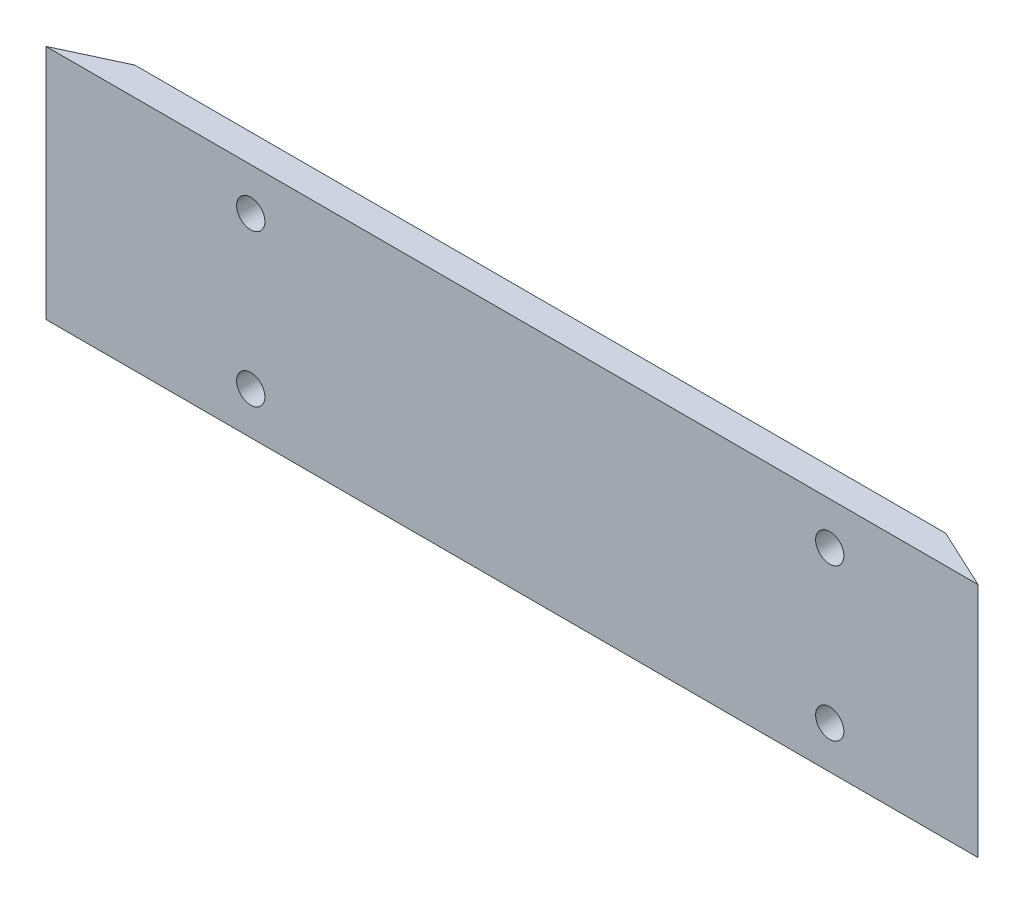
ISO-10303-21;
HEADER;
FILE_DESCRIPTION(('STEP AP214'),'2;1');
FILE_NAME('part.step','',(''),(''),'','','');
FILE_SCHEMA(('AUTOMOTIVE_DESIGN { 1 0 10303 214 1 1 1 1 }'));
ENDSEC;
DATA;
#1=APPLICATION_CONTEXT('core data for automotive mechanical design processes');
#2=APPLICATION_PROTOCOL_DEFINITION('international standard','automotive_design',2000,#1);
#3=PRODUCT_CONTEXT('',#1,'mechanical');
#4=PRODUCT('Part','Part','',(#3));
#5=PRODUCT_RELATED_PRODUCT_CATEGORY('part','',(#4));
#6=PRODUCT_DEFINITION_FORMATION('','',#4);
#7=PRODUCT_DEFINITION_CONTEXT('part definition',#1,'design');
#8=PRODUCT_DEFINITION('design','',#6,#7);
#9=PRODUCT_DEFINITION_SHAPE('','',#8);
#10=(LENGTH_UNIT() NAMED_UNIT(*) SI_UNIT(.MILLI.,.METRE.));
#11=(NAMED_UNIT(*) PLANE_ANGLE_UNIT() SI_UNIT($,.RADIAN.));
#12=(NAMED_UNIT(*) SI_UNIT($,.STERADIAN.) SOLID_ANGLE_UNIT());
#13=UNCERTAINTY_MEASURE_WITH_UNIT(LENGTH_MEASURE(1.E-05),#10,'distance_accuracy_value','');
#14=(GEOMETRIC_REPRESENTATION_CONTEXT(3) GLOBAL_UNCERTAINTY_ASSIGNED_CONTEXT((#13)) GLOBAL_UNIT_ASSIGNED_CONTEXT((#10,
#11,#12)) REPRESENTATION_CONTEXT('',''));
#15=CARTESIAN_POINT('',(0.,0.,0.));
#16=DIRECTION('',(0.,0.,1.));
#17=DIRECTION('',(1.,0.,0.));
#18=AXIS2_PLACEMENT_3D('',#15,#16,#17);
#19=CARTESIAN_POINT('',(-444.5,106.3625,12.7));
#20=DIRECTION('',(0.,0.,-1.));
#21=DIRECTION('',(-1.,0.,0.));
#22=AXIS2_PLACEMENT_3D('',#19,#20,#21);
#23=PLANE('',#22);
#24=CARTESIAN_POINT('',(260.35,-68.2625,12.7));
#25=DIRECTION('',(0.,0.,1.));
#26=DIRECTION('',(1.,0.,0.));
#27=AXIS2_PLACEMENT_3D('',#24,#25,#26);
#28=CIRCLE('',#27,12.7);
#29=CARTESIAN_POINT('',(273.05,-68.2625,12.7));
#30=VERTEX_POINT('',#29);
#31=EDGE_CURVE('E140',#30,#30,#28,.T.);
#32=ORIENTED_EDGE('',*,*,#31,.F.);
#33=EDGE_LOOP('',(#32));
#34=FACE_BOUND('',#33,.T.);
#35=CARTESIAN_POINT('',(-260.35,68.2625,12.7));
#36=DIRECTION('',(0.,0.,-1.));
#37=DIRECTION('',(-1.,0.,0.));
#38=AXIS2_PLACEMENT_3D('',#35,#36,#37);
#39=CIRCLE('',#38,12.7);
#40=CARTESIAN_POINT('',(-273.05,68.2625,12.7));
#41=VERTEX_POINT('',#40);
#42=EDGE_CURVE('E144',#41,#41,#39,.T.);
#43=ORIENTED_EDGE('',*,*,#42,.T.);
#44=EDGE_LOOP('',(#43));
#45=FACE_BOUND('',#44,.T.);
#46=CARTESIAN_POINT('',(-260.35,-68.2625,12.7));
#47=DIRECTION('',(0.,0.,-1.));
#48=DIRECTION('',(-1.,0.,0.));
#49=AXIS2_PLACEMENT_3D('',#46,#47,#48);
#50=CIRCLE('',#49,12.7);
#51=CARTESIAN_POINT('',(-273.05,-68.2625,12.7));
#52=VERTEX_POINT('',#51);
#53=EDGE_CURVE('E147',#52,#52,#50,.T.);
#54=ORIENTED_EDGE('',*,*,#53,.T.);
#55=EDGE_LOOP('',(#54));
#56=FACE_BOUND('',#55,.T.);
#57=DIRECTION('',(1.,0.,0.));
#58=VECTOR('',#57,1.);
#59=CARTESIAN_POINT('',(-444.5,-106.3625,12.7));
#60=LINE('',#59,#58);
#61=CARTESIAN_POINT('',(-444.5,-106.3625,12.7));
#62=VERTEX_POINT('',#61);
#63=CARTESIAN_POINT('',(393.7,-106.3625,12.7));
#64=VERTEX_POINT('',#63);
#65=EDGE_CURVE('E80',#62,#64,#60,.T.);
#66=ORIENTED_EDGE('',*,*,#65,.T.);
#67=DIRECTION('',(0.,-1.,0.));
#68=VECTOR('',#67,1.);
#69=CARTESIAN_POINT('',(393.7,106.3625,12.7));
#70=LINE('',#69,#68);
#71=CARTESIAN_POINT('',(393.7,106.3625,12.7));
#72=VERTEX_POINT('',#71);
#73=EDGE_CURVE('E47',#72,#64,#70,.T.);
#74=ORIENTED_EDGE('',*,*,#73,.F.);
#75=DIRECTION('',(1.,0.,0.));
#76=VECTOR('',#75,1.);
#77=CARTESIAN_POINT('',(-444.5,106.3625,12.7));
#78=LINE('',#77,#76);
#79=CARTESIAN_POINT('',(-444.5,106.3625,12.7));
#80=VERTEX_POINT('',#79);
#81=EDGE_CURVE('E92',#80,#72,#78,.T.);
#82=ORIENTED_EDGE('',*,*,#81,.F.);
#83=DIRECTION('',(0.,-1.,0.));
#84=VECTOR('',#83,1.);
#85=CARTESIAN_POINT('',(-444.5,106.3625,12.7));
#86=LINE('',#85,#84);
#87=EDGE_CURVE('E11',#80,#62,#86,.T.);
#88=ORIENTED_EDGE('',*,*,#87,.T.);
#89=EDGE_LOOP('',(#66,#74,#82,#88));
#90=FACE_BOUND('',#89,.T.);
#91=CARTESIAN_POINT('',(260.35,68.2625,12.7));
#92=DIRECTION('',(0.,0.,1.));
#93=DIRECTION('',(1.,0.,0.));
#94=AXIS2_PLACEMENT_3D('',#91,#92,#93);
#95=CIRCLE('',#94,12.7);
#96=CARTESIAN_POINT('',(273.05,68.2625,12.7));
#97=VERTEX_POINT('',#96);
#98=EDGE_CURVE('E224',#97,#97,#95,.T.);
#99=ORIENTED_EDGE('',*,*,#98,.F.);
#100=EDGE_LOOP('',(#99));
#101=FACE_BOUND('',#100,.T.);
#102=ADVANCED_FACE('F39',(#34,#45,#56,#90,#101),#23,.F.);
#103=CARTESIAN_POINT('',(-390.029524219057,106.3625,-12.7));
#104=DIRECTION('',(0.,0.,1.));
#105=DIRECTION('',(1.,0.,0.));
#106=AXIS2_PLACEMENT_3D('',#103,#104,#105);
#107=PLANE('',#106);
#108=CARTESIAN_POINT('',(260.35,68.2625,-12.7));
#109=DIRECTION('',(0.,0.,1.));
#110=DIRECTION('',(1.,0.,0.));
#111=AXIS2_PLACEMENT_3D('',#108,#109,#110);
#112=CIRCLE('',#111,4.953);
#113=CARTESIAN_POINT('',(265.303,68.2625,-12.7));
#114=VERTEX_POINT('',#113);
#115=EDGE_CURVE('E240',#114,#114,#112,.T.);
#116=ORIENTED_EDGE('',*,*,#115,.T.);
#117=EDGE_LOOP('',(#116));
#118=FACE_BOUND('',#117,.T.);
#119=CARTESIAN_POINT('',(-260.35,-68.2625,-12.7));
#120=DIRECTION('',(0.,0.,-1.));
#121=DIRECTION('',(-1.,0.,0.));
#122=AXIS2_PLACEMENT_3D('',#119,#120,#121);
#123=CIRCLE('',#122,4.953);
#124=CARTESIAN_POINT('',(-265.303,-68.2625,-12.7));
#125=VERTEX_POINT('',#124);
#126=EDGE_CURVE('E100',#125,#125,#123,.T.);
#127=ORIENTED_EDGE('',*,*,#126,.F.);
#128=EDGE_LOOP('',(#127));
#129=FACE_BOUND('',#128,.T.);
#130=CARTESIAN_POINT('',(-260.35,68.2625,-12.7));
#131=DIRECTION('',(0.,0.,-1.));
#132=DIRECTION('',(-1.,0.,0.));
#133=AXIS2_PLACEMENT_3D('',#130,#131,#132);
#134=CIRCLE('',#133,4.953);
#135=CARTESIAN_POINT('',(-265.303,68.2625,-12.7));
#136=VERTEX_POINT('',#135);
#137=EDGE_CURVE('E97',#136,#136,#134,.T.);
#138=ORIENTED_EDGE('',*,*,#137,.F.);
#139=EDGE_LOOP('',(#138));
#140=FACE_BOUND('',#139,.T.);
#141=DIRECTION('',(-1.,0.,0.));
#142=VECTOR('',#141,1.);
#143=CARTESIAN_POINT('',(-390.029524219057,-106.3625,-12.7));
#144=LINE('',#143,#142);
#145=CARTESIAN_POINT('',(339.229524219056,-106.3625,-12.7));
#146=VERTEX_POINT('',#145);
#147=CARTESIAN_POINT('',(-390.029524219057,-106.3625,-12.7));
#148=VERTEX_POINT('',#147);
#149=EDGE_CURVE('E105',#146,#148,#144,.T.);
#150=ORIENTED_EDGE('',*,*,#149,.T.);
#151=DIRECTION('',(0.,-1.,0.));
#152=VECTOR('',#151,1.);
#153=CARTESIAN_POINT('',(-390.029524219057,106.3625,-12.7));
#154=LINE('',#153,#152);
#155=CARTESIAN_POINT('',(-390.029524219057,106.3625,-12.7));
#156=VERTEX_POINT('',#155);
#157=EDGE_CURVE('E96',#156,#148,#154,.T.);
#158=ORIENTED_EDGE('',*,*,#157,.F.);
#159=DIRECTION('',(-1.,0.,0.));
#160=VECTOR('',#159,1.);
#161=CARTESIAN_POINT('',(-390.029524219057,106.3625,-12.7));
#162=LINE('',#161,#160);
#163=CARTESIAN_POINT('',(339.229524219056,106.3625,-12.7));
#164=VERTEX_POINT('',#163);
#165=EDGE_CURVE('E54',#164,#156,#162,.T.);
#166=ORIENTED_EDGE('',*,*,#165,.F.);
#167=DIRECTION('',(0.,-1.,0.));
#168=VECTOR('',#167,1.);
#169=CARTESIAN_POINT('',(339.229524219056,106.3625,-12.7));
#170=LINE('',#169,#168);
#171=EDGE_CURVE('E113',#164,#146,#170,.T.);
#172=ORIENTED_EDGE('',*,*,#171,.T.);
#173=EDGE_LOOP('',(#150,#158,#166,#172));
#174=FACE_BOUND('',#173,.T.);
#175=CARTESIAN_POINT('',(260.35,-68.2625,-12.7));
#176=DIRECTION('',(0.,0.,1.));
#177=DIRECTION('',(1.,0.,0.));
#178=AXIS2_PLACEMENT_3D('',#175,#176,#177);
#179=CIRCLE('',#178,4.953);
#180=CARTESIAN_POINT('',(265.303,-68.2625,-12.7));
#181=VERTEX_POINT('',#180);
#182=EDGE_CURVE('E237',#181,#181,#179,.T.);
#183=ORIENTED_EDGE('',*,*,#182,.T.);
#184=EDGE_LOOP('',(#183));
#185=FACE_BOUND('',#184,.T.);
#186=ADVANCED_FACE('F118',(#118,#129,#140,#174,#185),#107,.F.);
#187=CARTESIAN_POINT('',(-444.5,106.3625,12.7));
#188=DIRECTION('',(0.422618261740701,0.,0.906307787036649));
#189=DIRECTION('',(0.906307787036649,0.,-0.422618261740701));
#190=AXIS2_PLACEMENT_3D('',#187,#188,#189);
#191=PLANE('',#190);
#192=DIRECTION('',(-0.906307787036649,0.,0.422618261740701));
#193=VECTOR('',#192,1.);
#194=CARTESIAN_POINT('',(-444.5,-106.3625,12.7));
#195=LINE('',#194,#193);
#196=EDGE_CURVE('E84',#148,#62,#195,.T.);
#197=ORIENTED_EDGE('',*,*,#196,.T.);
#198=ORIENTED_EDGE('',*,*,#87,.F.);
#199=DIRECTION('',(-0.906307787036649,0.,0.422618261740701));
#200=VECTOR('',#199,1.);
#201=CARTESIAN_POINT('',(-444.5,106.3625,12.7));
#202=LINE('',#201,#200);
#203=EDGE_CURVE('E107',#156,#80,#202,.T.);
#204=ORIENTED_EDGE('',*,*,#203,.F.);
#205=ORIENTED_EDGE('',*,*,#157,.T.);
#206=EDGE_LOOP('',(#197,#198,#204,#205));
#207=FACE_BOUND('',#206,.T.);
#208=ADVANCED_FACE('F41',(#207),#191,.F.);
#209=CARTESIAN_POINT('',(393.7,106.3625,12.7));
#210=DIRECTION('',(-0.422618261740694,0.,0.906307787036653));
#211=DIRECTION('',(0.906307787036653,0.,0.422618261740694));
#212=AXIS2_PLACEMENT_3D('',#209,#210,#211);
#213=PLANE('',#212);
#214=DIRECTION('',(-0.906307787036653,0.,-0.422618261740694));
#215=VECTOR('',#214,1.);
#216=CARTESIAN_POINT('',(393.7,-106.3625,12.7));
#217=LINE('',#216,#215);
#218=EDGE_CURVE('E85',#64,#146,#217,.T.);
#219=ORIENTED_EDGE('',*,*,#218,.T.);
#220=ORIENTED_EDGE('',*,*,#171,.F.);
#221=DIRECTION('',(-0.906307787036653,0.,-0.422618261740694));
#222=VECTOR('',#221,1.);
#223=CARTESIAN_POINT('',(393.7,106.3625,12.7));
#224=LINE('',#223,#222);
#225=EDGE_CURVE('E59',#72,#164,#224,.T.);
#226=ORIENTED_EDGE('',*,*,#225,.F.);
#227=ORIENTED_EDGE('',*,*,#73,.T.);
#228=EDGE_LOOP('',(#219,#220,#226,#227));
#229=FACE_BOUND('',#228,.T.);
#230=ADVANCED_FACE('F116',(#229),#213,.F.);
#231=CARTESIAN_POINT('',(-25.4000000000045,106.3625,-182.729539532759));
#232=DIRECTION('',(0.,1.,0.));
#233=DIRECTION('',(0.,0.,1.));
#234=AXIS2_PLACEMENT_3D('',#231,#232,#233);
#235=PLANE('',#234);
#236=ORIENTED_EDGE('',*,*,#203,.T.);
#237=ORIENTED_EDGE('',*,*,#81,.T.);
#238=ORIENTED_EDGE('',*,*,#225,.T.);
#239=ORIENTED_EDGE('',*,*,#165,.T.);
#240=EDGE_LOOP('',(#236,#237,#238,#239));
#241=FACE_BOUND('',#240,.T.);
#242=ADVANCED_FACE('F120',(#241),#235,.T.);
#243=CARTESIAN_POINT('',(-25.4000000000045,-106.3625,-182.729539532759));
#244=DIRECTION('',(0.,1.,0.));
#245=DIRECTION('',(0.,0.,1.));
#246=AXIS2_PLACEMENT_3D('',#243,#244,#245);
#247=PLANE('',#246);
#248=ORIENTED_EDGE('',*,*,#196,.F.);
#249=ORIENTED_EDGE('',*,*,#149,.F.);
#250=ORIENTED_EDGE('',*,*,#218,.F.);
#251=ORIENTED_EDGE('',*,*,#65,.F.);
#252=EDGE_LOOP('',(#248,#249,#250,#251));
#253=FACE_BOUND('',#252,.T.);
#254=ADVANCED_FACE('F81',(#253),#247,.F.);
#255=CARTESIAN_POINT('',(-260.35,68.2625,-6.35));
#256=DIRECTION('',(0.,0.,-1.));
#257=DIRECTION('',(-1.,0.,0.));
#258=AXIS2_PLACEMENT_3D('',#255,#256,#257);
#259=CYLINDRICAL_SURFACE('',#258,4.953);
#260=CARTESIAN_POINT('',(-260.35,68.2625,-6.35));
#261=DIRECTION('',(0.,0.,-1.));
#262=DIRECTION('',(-1.,0.,0.));
#263=AXIS2_PLACEMENT_3D('',#260,#261,#262);
#264=CIRCLE('',#263,4.953);
#265=CARTESIAN_POINT('',(-265.303,68.2625,-6.35));
#266=VERTEX_POINT('',#265);
#267=EDGE_CURVE('E155',#266,#266,#264,.F.);
#268=ORIENTED_EDGE('',*,*,#267,.T.);
#269=EDGE_LOOP('',(#268));
#270=FACE_BOUND('',#269,.T.);
#271=ORIENTED_EDGE('',*,*,#137,.T.);
#272=EDGE_LOOP('',(#271));
#273=FACE_BOUND('',#272,.T.);
#274=ADVANCED_FACE('F127',(#270,#273),#259,.F.);
#275=CARTESIAN_POINT('',(-260.35,-68.2625,-6.35));
#276=DIRECTION('',(0.,0.,-1.));
#277=DIRECTION('',(-1.,0.,0.));
#278=AXIS2_PLACEMENT_3D('',#275,#276,#277);
#279=CYLINDRICAL_SURFACE('',#278,4.953);
#280=CARTESIAN_POINT('',(-260.35,-68.2625,-6.35));
#281=DIRECTION('',(0.,0.,-1.));
#282=DIRECTION('',(-1.,0.,0.));
#283=AXIS2_PLACEMENT_3D('',#280,#281,#282);
#284=CIRCLE('',#283,4.953);
#285=CARTESIAN_POINT('',(-265.303,-68.2625,-6.35));
#286=VERTEX_POINT('',#285);
#287=EDGE_CURVE('E149',#286,#286,#284,.F.);
#288=ORIENTED_EDGE('',*,*,#287,.T.);
#289=EDGE_LOOP('',(#288));
#290=FACE_BOUND('',#289,.T.);
#291=ORIENTED_EDGE('',*,*,#126,.T.);
#292=EDGE_LOOP('',(#291));
#293=FACE_BOUND('',#292,.T.);
#294=ADVANCED_FACE('F161',(#290,#293),#279,.F.);
#295=CARTESIAN_POINT('',(-260.35,-68.2625,-6.35));
#296=DIRECTION('',(0.,0.,-1.));
#297=DIRECTION('',(-1.,0.,0.));
#298=AXIS2_PLACEMENT_3D('',#295,#296,#297);
#299=PLANE('',#298);
#300=CARTESIAN_POINT('',(-260.35,-68.2625,-6.35));
#301=DIRECTION('',(0.,0.,-1.));
#302=DIRECTION('',(-1.,0.,0.));
#303=AXIS2_PLACEMENT_3D('',#300,#301,#302);
#304=CIRCLE('',#303,12.7);
#305=CARTESIAN_POINT('',(-273.05,-68.2625,-6.35));
#306=VERTEX_POINT('',#305);
#307=EDGE_CURVE('E150',#306,#306,#304,.T.);
#308=ORIENTED_EDGE('',*,*,#307,.F.);
#309=EDGE_LOOP('',(#308));
#310=FACE_BOUND('',#309,.T.);
#311=ORIENTED_EDGE('',*,*,#287,.F.);
#312=EDGE_LOOP('',(#311));
#313=FACE_BOUND('',#312,.T.);
#314=ADVANCED_FACE('F172',(#310,#313),#299,.F.);
#315=CARTESIAN_POINT('',(-260.35,-68.2625,12.7));
#316=DIRECTION('',(0.,0.,-1.));
#317=DIRECTION('',(-1.,0.,0.));
#318=AXIS2_PLACEMENT_3D('',#315,#316,#317);
#319=CYLINDRICAL_SURFACE('',#318,12.7);
#320=CARTESIAN_POINT('',(-273.05,-68.2625,12.7));
#321=CARTESIAN_POINT('',(-273.05,-68.2625,12.5015625));
#322=CARTESIAN_POINT('',(-273.05,-68.2625,12.303125));
#323=CARTESIAN_POINT('',(-273.05,-68.2625,11.90625));
#324=CARTESIAN_POINT('',(-273.05,-68.2625,11.7078125));
#325=CARTESIAN_POINT('',(-273.05,-68.2625,11.3109375));
#326=CARTESIAN_POINT('',(-273.05,-68.2625,11.1125));
#327=CARTESIAN_POINT('',(-273.05,-68.2625,10.715625));
#328=CARTESIAN_POINT('',(-273.05,-68.2625,10.5171875));
#329=CARTESIAN_POINT('',(-273.05,-68.2625,10.1203125));
#330=CARTESIAN_POINT('',(-273.05,-68.2625,9.92187500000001));
#331=CARTESIAN_POINT('',(-273.05,-68.2625,9.525));
#332=CARTESIAN_POINT('',(-273.05,-68.2625,9.3265625));
#333=CARTESIAN_POINT('',(-273.05,-68.2625,8.92968750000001));
#334=CARTESIAN_POINT('',(-273.05,-68.2625,8.73125));
#335=CARTESIAN_POINT('',(-273.05,-68.2625,8.334375));
#336=CARTESIAN_POINT('',(-273.05,-68.2625,8.13593750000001));
#337=CARTESIAN_POINT('',(-273.05,-68.2625,7.73906250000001));
#338=CARTESIAN_POINT('',(-273.05,-68.2625,7.540625));
#339=CARTESIAN_POINT('',(-273.05,-68.2625,7.14375000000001));
#340=CARTESIAN_POINT('',(-273.05,-68.2625,6.9453125));
#341=CARTESIAN_POINT('',(-273.05,-68.2625,6.5484375));
#342=CARTESIAN_POINT('',(-273.05,-68.2625,6.35));
#343=CARTESIAN_POINT('',(-273.05,-68.2625,5.95312500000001));
#344=CARTESIAN_POINT('',(-273.05,-68.2625,5.7546875));
#345=CARTESIAN_POINT('',(-273.05,-68.2625,5.3578125));
#346=CARTESIAN_POINT('',(-273.05,-68.2625,5.159375));
#347=CARTESIAN_POINT('',(-273.05,-68.2625,4.76250000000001));
#348=CARTESIAN_POINT('',(-273.05,-68.2625,4.56406250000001));
#349=CARTESIAN_POINT('',(-273.05,-68.2625,4.16718750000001));
#350=CARTESIAN_POINT('',(-273.05,-68.2625,3.96875000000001));
#351=CARTESIAN_POINT('',(-273.05,-68.2625,3.57187500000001));
#352=CARTESIAN_POINT('',(-273.05,-68.2625,3.37343750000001));
#353=CARTESIAN_POINT('',(-273.05,-68.2625,2.97656250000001));
#354=CARTESIAN_POINT('',(-273.05,-68.2625,2.77812500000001));
#355=CARTESIAN_POINT('',(-273.05,-68.2625,2.38125000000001));
#356=CARTESIAN_POINT('',(-273.05,-68.2625,2.18281250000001));
#357=CARTESIAN_POINT('',(-273.05,-68.2625,1.78593750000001));
#358=CARTESIAN_POINT('',(-273.05,-68.2625,1.58750000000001));
#359=CARTESIAN_POINT('',(-273.05,-68.2625,1.190625));
#360=CARTESIAN_POINT('',(-273.05,-68.2625,0.992187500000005));
#361=CARTESIAN_POINT('',(-273.05,-68.2625,0.595312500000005));
#362=CARTESIAN_POINT('',(-273.05,-68.2625,0.396875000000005));
#363=CARTESIAN_POINT('',(-273.05,-68.2625,0.));
#364=CARTESIAN_POINT('',(-273.05,-68.2625,-0.198437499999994));
#365=CARTESIAN_POINT('',(-273.05,-68.2625,-0.595312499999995));
#366=CARTESIAN_POINT('',(-273.05,-68.2625,-0.793749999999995));
#367=CARTESIAN_POINT('',(-273.05,-68.2625,-1.19062499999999));
#368=CARTESIAN_POINT('',(-273.05,-68.2625,-1.3890625));
#369=CARTESIAN_POINT('',(-273.05,-68.2625,-1.7859375));
#370=CARTESIAN_POINT('',(-273.05,-68.2625,-1.984375));
#371=CARTESIAN_POINT('',(-273.05,-68.2625,-2.38125));
#372=CARTESIAN_POINT('',(-273.05,-68.2625,-2.5796875));
#373=CARTESIAN_POINT('',(-273.05,-68.2625,-2.9765625));
#374=CARTESIAN_POINT('',(-273.05,-68.2625,-3.17499999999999));
#375=CARTESIAN_POINT('',(-273.05,-68.2625,-3.57187499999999));
#376=CARTESIAN_POINT('',(-273.05,-68.2625,-3.77031249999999));
#377=CARTESIAN_POINT('',(-273.05,-68.2625,-4.16718749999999));
#378=CARTESIAN_POINT('',(-273.05,-68.2625,-4.365625));
#379=CARTESIAN_POINT('',(-273.05,-68.2625,-4.76249999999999));
#380=CARTESIAN_POINT('',(-273.05,-68.2625,-4.9609375));
#381=CARTESIAN_POINT('',(-273.05,-68.2625,-5.3578125));
#382=CARTESIAN_POINT('',(-273.05,-68.2625,-5.55625));
#383=CARTESIAN_POINT('',(-273.05,-68.2625,-5.953125));
#384=CARTESIAN_POINT('',(-273.05,-68.2625,-6.1515625));
#385=CARTESIAN_POINT('',(-273.05,-68.2625,-6.35));
#386=B_SPLINE_CURVE_WITH_KNOTS('',3,(#320,#321,#322,#323,#324,#325,#326,#327,#328,#329,#330,
#331,#332,#333,#334,#335,#336,#337,#338,#339,#340,#341,#342,#343,#344,#345,#346,#347,#348,#349,
#350,#351,#352,#353,#354,#355,#356,#357,#358,#359,#360,#361,#362,#363,#364,#365,#366,#367,#368,
#369,#370,#371,#372,#373,#374,#375,#376,#377,#378,#379,#380,#381,#382,#383,#384,#385),
.UNSPECIFIED.,.F.,.F.,(4,2,2,2,2,2,2,2,2,2,2,2,2,2,2,2,2,2,2,2,2,2,2,2,2,2,2,2,2,2,2,2,4),(0.,
0.5953125,1.190625,1.7859375,2.38125,2.9765625,3.571875,4.1671875,4.7625,5.3578125,5.953125,
6.5484375,7.14375,7.7390625,8.334375,8.9296875,9.525,10.1203125,10.715625,11.3109375,11.90625,
12.5015625,13.096875,13.6921875,14.2875,14.8828125,15.478125,16.0734375,16.66875,17.2640625,
17.859375,18.4546875,19.05),.UNSPECIFIED.);
#387=EDGE_CURVE('BSEAM177',#52,#306,#386,.T.);
#388=ORIENTED_EDGE('',*,*,#53,.F.);
#389=ORIENTED_EDGE('',*,*,#307,.T.);
#390=ORIENTED_EDGE('',*,*,#387,.T.);
#391=ORIENTED_EDGE('',*,*,#387,.F.);
#392=EDGE_LOOP('',(#388,#390,#389,#391));
#393=FACE_BOUND('',#392,.T.);
#394=ADVANCED_FACE('F177',(#393),#319,.F.);
#395=CARTESIAN_POINT('',(-260.35,68.2625,-6.35));
#396=DIRECTION('',(0.,0.,-1.));
#397=DIRECTION('',(-1.,0.,0.));
#398=AXIS2_PLACEMENT_3D('',#395,#396,#397);
#399=PLANE('',#398);
#400=CARTESIAN_POINT('',(-260.35,68.2625,-6.35));
#401=DIRECTION('',(0.,0.,-1.));
#402=DIRECTION('',(-1.,0.,0.));
#403=AXIS2_PLACEMENT_3D('',#400,#401,#402);
#404=CIRCLE('',#403,12.7);
#405=CARTESIAN_POINT('',(-273.05,68.2625,-6.35));
#406=VERTEX_POINT('',#405);
#407=EDGE_CURVE('E243',#406,#406,#404,.T.);
#408=ORIENTED_EDGE('',*,*,#407,.F.);
#409=EDGE_LOOP('',(#408));
#410=FACE_BOUND('',#409,.T.);
#411=ORIENTED_EDGE('',*,*,#267,.F.);
#412=EDGE_LOOP('',(#411));
#413=FACE_BOUND('',#412,.T.);
#414=ADVANCED_FACE('F180',(#410,#413),#399,.F.);
#415=CARTESIAN_POINT('',(-260.35,68.2625,12.7));
#416=DIRECTION('',(0.,0.,-1.));
#417=DIRECTION('',(-1.,0.,0.));
#418=AXIS2_PLACEMENT_3D('',#415,#416,#417);
#419=CYLINDRICAL_SURFACE('',#418,12.7);
#420=CARTESIAN_POINT('',(-273.05,68.2625,12.7));
#421=CARTESIAN_POINT('',(-273.05,68.2625,12.5015625));
#422=CARTESIAN_POINT('',(-273.05,68.2625,12.303125));
#423=CARTESIAN_POINT('',(-273.05,68.2625,11.90625));
#424=CARTESIAN_POINT('',(-273.05,68.2625,11.7078125));
#425=CARTESIAN_POINT('',(-273.05,68.2625,11.3109375));
#426=CARTESIAN_POINT('',(-273.05,68.2625,11.1125));
#427=CARTESIAN_POINT('',(-273.05,68.2625,10.715625));
#428=CARTESIAN_POINT('',(-273.05,68.2625,10.5171875));
#429=CARTESIAN_POINT('',(-273.05,68.2625,10.1203125));
#430=CARTESIAN_POINT('',(-273.05,68.2625,9.92187500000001));
#431=CARTESIAN_POINT('',(-273.05,68.2625,9.525));
#432=CARTESIAN_POINT('',(-273.05,68.2625,9.3265625));
#433=CARTESIAN_POINT('',(-273.05,68.2625,8.92968750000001));
#434=CARTESIAN_POINT('',(-273.05,68.2625,8.73125));
#435=CARTESIAN_POINT('',(-273.05,68.2625,8.334375));
#436=CARTESIAN_POINT('',(-273.05,68.2625,8.13593750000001));
#437=CARTESIAN_POINT('',(-273.05,68.2625,7.73906250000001));
#438=CARTESIAN_POINT('',(-273.05,68.2625,7.540625));
#439=CARTESIAN_POINT('',(-273.05,68.2625,7.14375000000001));
#440=CARTESIAN_POINT('',(-273.05,68.2625,6.9453125));
#441=CARTESIAN_POINT('',(-273.05,68.2625,6.5484375));
#442=CARTESIAN_POINT('',(-273.05,68.2625,6.35));
#443=CARTESIAN_POINT('',(-273.05,68.2625,5.95312500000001));
#444=CARTESIAN_POINT('',(-273.05,68.2625,5.7546875));
#445=CARTESIAN_POINT('',(-273.05,68.2625,5.3578125));
#446=CARTESIAN_POINT('',(-273.05,68.2625,5.159375));
#447=CARTESIAN_POINT('',(-273.05,68.2625,4.76250000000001));
#448=CARTESIAN_POINT('',(-273.05,68.2625,4.56406250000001));
#449=CARTESIAN_POINT('',(-273.05,68.2625,4.16718750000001));
#450=CARTESIAN_POINT('',(-273.05,68.2625,3.96875000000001));
#451=CARTESIAN_POINT('',(-273.05,68.2625,3.57187500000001));
#452=CARTESIAN_POINT('',(-273.05,68.2625,3.37343750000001));
#453=CARTESIAN_POINT('',(-273.05,68.2625,2.97656250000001));
#454=CARTESIAN_POINT('',(-273.05,68.2625,2.77812500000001));
#455=CARTESIAN_POINT('',(-273.05,68.2625,2.38125000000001));
#456=CARTESIAN_POINT('',(-273.05,68.2625,2.18281250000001));
#457=CARTESIAN_POINT('',(-273.05,68.2625,1.78593750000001));
#458=CARTESIAN_POINT('',(-273.05,68.2625,1.58750000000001));
#459=CARTESIAN_POINT('',(-273.05,68.2625,1.190625));
#460=CARTESIAN_POINT('',(-273.05,68.2625,0.992187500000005));
#461=CARTESIAN_POINT('',(-273.05,68.2625,0.595312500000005));
#462=CARTESIAN_POINT('',(-273.05,68.2625,0.396875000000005));
#463=CARTESIAN_POINT('',(-273.05,68.2625,0.));
#464=CARTESIAN_POINT('',(-273.05,68.2625,-0.198437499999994));
#465=CARTESIAN_POINT('',(-273.05,68.2625,-0.595312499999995));
#466=CARTESIAN_POINT('',(-273.05,68.2625,-0.793749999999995));
#467=CARTESIAN_POINT('',(-273.05,68.2625,-1.19062499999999));
#468=CARTESIAN_POINT('',(-273.05,68.2625,-1.3890625));
#469=CARTESIAN_POINT('',(-273.05,68.2625,-1.7859375));
#470=CARTESIAN_POINT('',(-273.05,68.2625,-1.984375));
#471=CARTESIAN_POINT('',(-273.05,68.2625,-2.38125));
#472=CARTESIAN_POINT('',(-273.05,68.2625,-2.5796875));
#473=CARTESIAN_POINT('',(-273.05,68.2625,-2.9765625));
#474=CARTESIAN_POINT('',(-273.05,68.2625,-3.17499999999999));
#475=CARTESIAN_POINT('',(-273.05,68.2625,-3.57187499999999));
#476=CARTESIAN_POINT('',(-273.05,68.2625,-3.77031249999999));
#477=CARTESIAN_POINT('',(-273.05,68.2625,-4.16718749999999));
#478=CARTESIAN_POINT('',(-273.05,68.2625,-4.365625));
#479=CARTESIAN_POINT('',(-273.05,68.2625,-4.76249999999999));
#480=CARTESIAN_POINT('',(-273.05,68.2625,-4.9609375));
#481=CARTESIAN_POINT('',(-273.05,68.2625,-5.3578125));
#482=CARTESIAN_POINT('',(-273.05,68.2625,-5.55625));
#483=CARTESIAN_POINT('',(-273.05,68.2625,-5.953125));
#484=CARTESIAN_POINT('',(-273.05,68.2625,-6.1515625));
#485=CARTESIAN_POINT('',(-273.05,68.2625,-6.35));
#486=B_SPLINE_CURVE_WITH_KNOTS('',3,(#420,#421,#422,#423,#424,#425,#426,#427,#428,#429,#430,
#431,#432,#433,#434,#435,#436,#437,#438,#439,#440,#441,#442,#443,#444,#445,#446,#447,#448,#449,
#450,#451,#452,#453,#454,#455,#456,#457,#458,#459,#460,#461,#462,#463,#464,#465,#466,#467,#468,
#469,#470,#471,#472,#473,#474,#475,#476,#477,#478,#479,#480,#481,#482,#483,#484,#485),
.UNSPECIFIED.,.F.,.F.,(4,2,2,2,2,2,2,2,2,2,2,2,2,2,2,2,2,2,2,2,2,2,2,2,2,2,2,2,2,2,2,2,4),(0.,
0.5953125,1.190625,1.7859375,2.38125,2.9765625,3.571875,4.1671875,4.7625,5.3578125,5.953125,
6.5484375,7.14375,7.7390625,8.334375,8.9296875,9.525,10.1203125,10.715625,11.3109375,11.90625,
12.5015625,13.096875,13.6921875,14.2875,14.8828125,15.478125,16.0734375,16.66875,17.2640625,
17.859375,18.4546875,19.05),.UNSPECIFIED.);
#487=EDGE_CURVE('BSEAM184',#41,#406,#486,.T.);
#488=ORIENTED_EDGE('',*,*,#42,.F.);
#489=ORIENTED_EDGE('',*,*,#407,.T.);
#490=ORIENTED_EDGE('',*,*,#487,.T.);
#491=ORIENTED_EDGE('',*,*,#487,.F.);
#492=EDGE_LOOP('',(#488,#490,#489,#491));
#493=FACE_BOUND('',#492,.T.);
#494=ADVANCED_FACE('F184',(#493),#419,.F.);
#495=CARTESIAN_POINT('',(260.35,68.2625,-6.35));
#496=DIRECTION('',(0.,0.,-1.));
#497=DIRECTION('',(-1.,0.,0.));
#498=AXIS2_PLACEMENT_3D('',#495,#496,#497);
#499=CYLINDRICAL_SURFACE('',#498,4.953);
#500=CARTESIAN_POINT('',(260.35,68.2625,-6.35));
#501=DIRECTION('',(0.,0.,-1.));
#502=DIRECTION('',(-1.,0.,0.));
#503=AXIS2_PLACEMENT_3D('',#500,#501,#502);
#504=CIRCLE('',#503,4.953);
#505=CARTESIAN_POINT('',(255.397,68.2625,-6.35));
#506=VERTEX_POINT('',#505);
#507=EDGE_CURVE('E219',#506,#506,#504,.T.);
#508=ORIENTED_EDGE('',*,*,#507,.F.);
#509=EDGE_LOOP('',(#508));
#510=FACE_BOUND('',#509,.T.);
#511=ORIENTED_EDGE('',*,*,#115,.F.);
#512=EDGE_LOOP('',(#511));
#513=FACE_BOUND('',#512,.T.);
#514=ADVANCED_FACE('F187',(#510,#513),#499,.F.);
#515=CARTESIAN_POINT('',(260.35,-68.2625,-6.35));
#516=DIRECTION('',(0.,0.,-1.));
#517=DIRECTION('',(-1.,0.,0.));
#518=AXIS2_PLACEMENT_3D('',#515,#516,#517);
#519=CYLINDRICAL_SURFACE('',#518,4.953);
#520=CARTESIAN_POINT('',(260.35,-68.2625,-6.35));
#521=DIRECTION('',(0.,0.,-1.));
#522=DIRECTION('',(-1.,0.,0.));
#523=AXIS2_PLACEMENT_3D('',#520,#521,#522);
#524=CIRCLE('',#523,4.953);
#525=CARTESIAN_POINT('',(255.397,-68.2625,-6.35));
#526=VERTEX_POINT('',#525);
#527=EDGE_CURVE('E234',#526,#526,#524,.T.);
#528=ORIENTED_EDGE('',*,*,#527,.F.);
#529=EDGE_LOOP('',(#528));
#530=FACE_BOUND('',#529,.T.);
#531=ORIENTED_EDGE('',*,*,#182,.F.);
#532=EDGE_LOOP('',(#531));
#533=FACE_BOUND('',#532,.T.);
#534=ADVANCED_FACE('F194',(#530,#533),#519,.F.);
#535=CARTESIAN_POINT('',(260.35,-68.2625,12.7));
#536=DIRECTION('',(0.,0.,-1.));
#537=DIRECTION('',(-1.,0.,0.));
#538=AXIS2_PLACEMENT_3D('',#535,#536,#537);
#539=CYLINDRICAL_SURFACE('',#538,12.7);
#540=ORIENTED_EDGE('',*,*,#31,.T.);
#541=EDGE_LOOP('',(#540));
#542=FACE_BOUND('',#541,.T.);
#543=CARTESIAN_POINT('',(260.35,-68.2625,-6.35));
#544=DIRECTION('',(0.,0.,1.));
#545=DIRECTION('',(1.,0.,0.));
#546=AXIS2_PLACEMENT_3D('',#543,#544,#545);
#547=CIRCLE('',#546,12.7);
#548=CARTESIAN_POINT('',(273.05,-68.2625,-6.35));
#549=VERTEX_POINT('',#548);
#550=EDGE_CURVE('E230',#549,#549,#547,.T.);
#551=ORIENTED_EDGE('',*,*,#550,.F.);
#552=EDGE_LOOP('',(#551));
#553=FACE_BOUND('',#552,.T.);
#554=ADVANCED_FACE('F198',(#542,#553),#539,.F.);
#555=CARTESIAN_POINT('',(260.35,-68.2625,-6.35));
#556=DIRECTION('',(0.,0.,-1.));
#557=DIRECTION('',(1.,0.,0.));
#558=AXIS2_PLACEMENT_3D('',#555,#556,#557);
#559=PLANE('',#558);
#560=ORIENTED_EDGE('',*,*,#527,.T.);
#561=EDGE_LOOP('',(#560));
#562=FACE_BOUND('',#561,.T.);
#563=ORIENTED_EDGE('',*,*,#550,.T.);
#564=EDGE_LOOP('',(#563));
#565=FACE_BOUND('',#564,.T.);
#566=ADVANCED_FACE('F202',(#562,#565),#559,.F.);
#567=CARTESIAN_POINT('',(260.35,68.2625,12.7));
#568=DIRECTION('',(0.,0.,-1.));
#569=DIRECTION('',(-1.,0.,0.));
#570=AXIS2_PLACEMENT_3D('',#567,#568,#569);
#571=CYLINDRICAL_SURFACE('',#570,12.7);
#572=ORIENTED_EDGE('',*,*,#98,.T.);
#573=EDGE_LOOP('',(#572));
#574=FACE_BOUND('',#573,.T.);
#575=CARTESIAN_POINT('',(260.35,68.2625,-6.35));
#576=DIRECTION('',(0.,0.,1.));
#577=DIRECTION('',(1.,0.,0.));
#578=AXIS2_PLACEMENT_3D('',#575,#576,#577);
#579=CIRCLE('',#578,12.7);
#580=CARTESIAN_POINT('',(273.05,68.2625,-6.35));
#581=VERTEX_POINT('',#580);
#582=EDGE_CURVE('E222',#581,#581,#579,.T.);
#583=ORIENTED_EDGE('',*,*,#582,.F.);
#584=EDGE_LOOP('',(#583));
#585=FACE_BOUND('',#584,.T.);
#586=ADVANCED_FACE('F206',(#574,#585),#571,.F.);
#587=CARTESIAN_POINT('',(260.35,68.2625,-6.35));
#588=DIRECTION('',(0.,0.,-1.));
#589=DIRECTION('',(1.,0.,0.));
#590=AXIS2_PLACEMENT_3D('',#587,#588,#589);
#591=PLANE('',#590);
#592=ORIENTED_EDGE('',*,*,#507,.T.);
#593=EDGE_LOOP('',(#592));
#594=FACE_BOUND('',#593,.T.);
#595=ORIENTED_EDGE('',*,*,#582,.T.);
#596=EDGE_LOOP('',(#595));
#597=FACE_BOUND('',#596,.T.);
#598=ADVANCED_FACE('F210',(#594,#597),#591,.F.);
#599=CLOSED_SHELL('',(#102,#186,#208,#230,#242,#254,#274,#294,#314,#394,#414,#494,#514,#534,
#554,#566,#586,#598));
#600=MANIFOLD_SOLID_BREP('B2',#599);
#601=ADVANCED_BREP_SHAPE_REPRESENTATION('',(#18,#600),#14);
#602=SHAPE_DEFINITION_REPRESENTATION(#9,#601);
ENDSEC;
END-ISO-10303-21;
